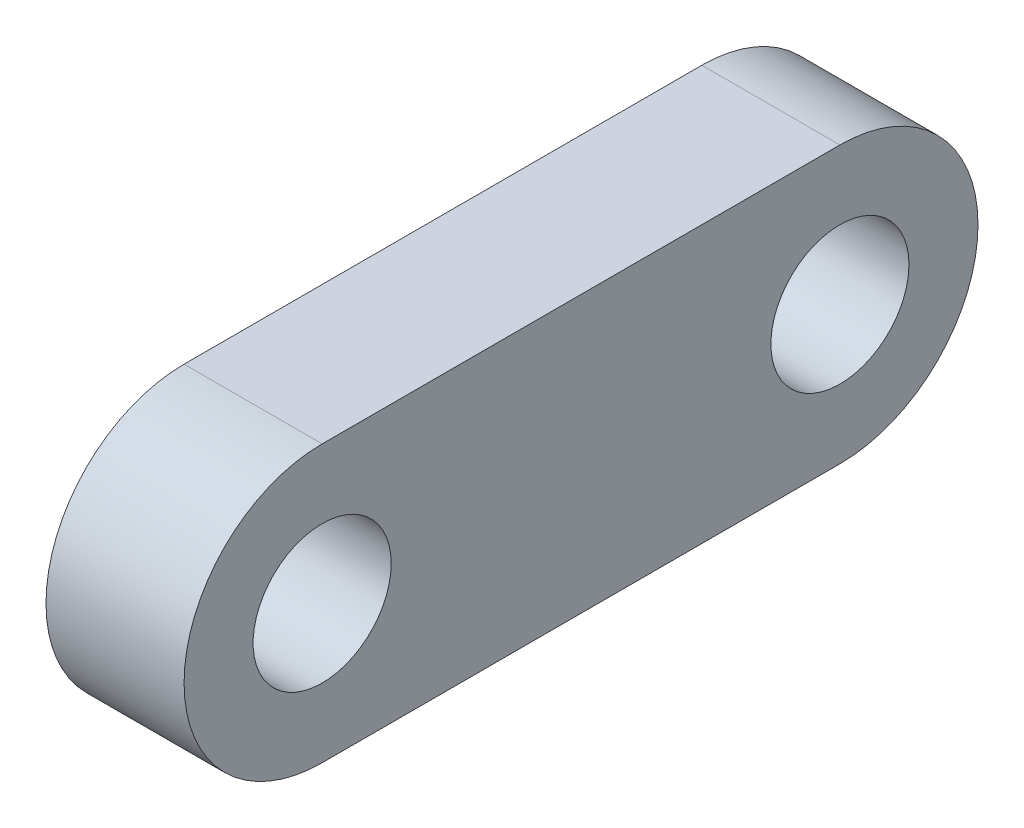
from build123d import *

# Parameters (mm, degrees)
SKETCH1_R           = 20
BOSS_EXTRUDE1_DEPTH = 20


with BuildPart() as part:
    # Sketch1 → Boss-Extrude1 (new, symmetric)
    with BuildSketch(Plane(origin=(0, 0, 0), x_dir=(0, 0, -1), z_dir=(1, 0, 0))):
        with BuildLine():
            Line((-75, 40), (75, 40))
            ThreePointArc((75, 40), (115, 0), (75, -40))
            Line((75, -40), (-75, -40))
            ThreePointArc((-75, -40), (-115, 0), (-75, 40))
        make_face()
        with Locations((-75, 0)):
            Circle(SKETCH1_R, mode=Mode.SUBTRACT)
        with Locations((75, 0)):
            Circle(SKETCH1_R, mode=Mode.SUBTRACT)
    extrude(amount=BOSS_EXTRUDE1_DEPTH, both=True)


solid = part.part
